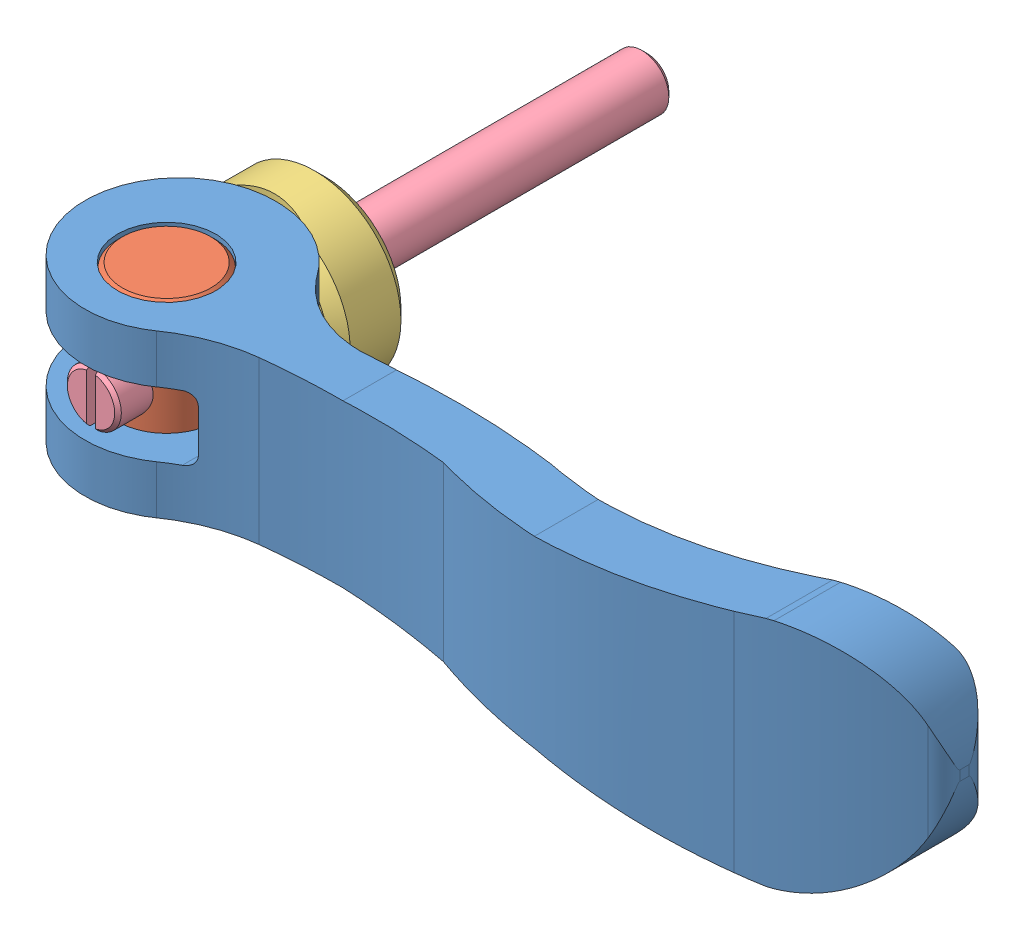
SolidWorks assembly KCL05X30-SUS.SLDASM, configuration Default (file format 15000). Lengths in mm.
Overall size (79.19 21.52 52.07).
4 component instances, 4 part files, 0 mates.
Components (placement in the parent):
- KCL05X30-SUS_01-1: KCL05X30-SUS_01.SLDPRT [ﾃﾞﾌｫﾙﾄ] at (0 0 14.7) x (1 0 0) z (0 -1 0) size (79.19 17.58 21.52)
- KCL05X30-SUS_02-1: KCL05X30-SUS_02.SLDPRT [ﾃﾞﾌｫﾙﾄ] at (0 0 14.7) x (0 1 0) z (1 0 0) size (15 9 9)
- KCL05X30-SUS_03-1: KCL05X30-SUS_03.SLDPRT [ﾃﾞﾌｫﾙﾄ] x (1 0 0) z (0 -1 0) size (16 7.24 16)
- KCL05X30-SUS_04-1: KCL05X30-SUS_04.SLDPRT [ﾃﾞﾌｫﾙﾄ] at (0 0 -19.8) x (0 1 0) z (1 0 0) size (5 51.5 5)
